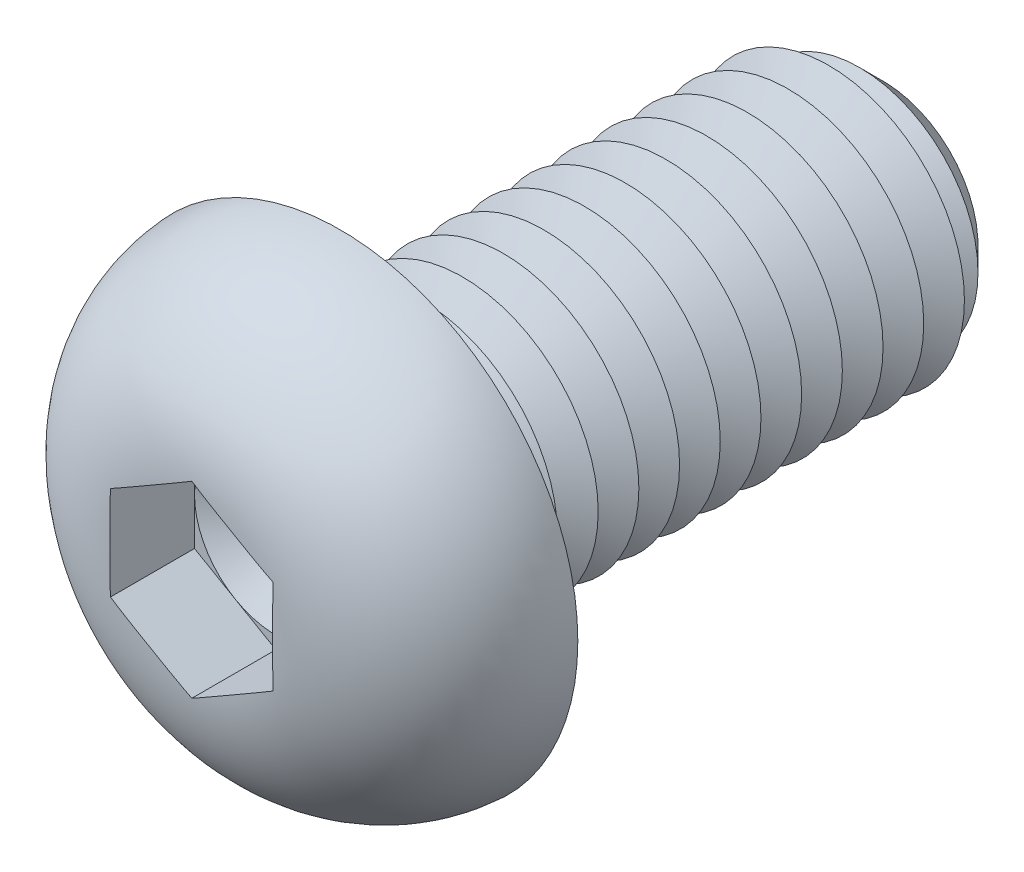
from build123d import *

# Parameters (mm, degrees)
CUT_EXTRUDE1_DEPTH  = 3.12
SKETCH4_R           = 5
BOSS_EXTRUDE1_DEPTH = 20
CHAMFER1_SIZE       = 1.5
LPATTERN1_COUNT     = 12
LPATTERN1_PITCH     = 1.5
FILLET2_R           = 0.6


with BuildPart() as part:
    # Sketch2 → Revolve1 (revolve)
    with BuildSketch(Plane(origin=(0, 0, 0), x_dir=(0, 0, -1), z_dir=(1, 0, 0)), mode=Mode.PRIVATE) as revolve1_sk:
        with BuildLine():
            Line((0, 0), (-5.5, 0))
            Line((-5.5, 0), (-5.5, 2.957763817))
            ThreePointArc((-5.5, 2.957763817), (-3.905948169, 6.951508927), (0, 8.75))
            Line((0, 8.75), (0, 0))
        make_face()
    revolve(revolve1_sk.sketch.rotate(Axis((0, 0, 47.934239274), (0, 0, -1)), 90), axis=Axis((0, 0, 47.934239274), (0, 0, -1)))

    # Sketch3 → Cut-Extrude1 (cut)
    with BuildSketch(Plane.XY.offset(5.5)):
        Polygon((0, 3.464101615), (-3, 1.732050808), (-3, -1.732050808), (0, -3.464101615), (3, -1.732050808), (3, 1.732050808), align=None)
    extrude(amount=-CUT_EXTRUDE1_DEPTH, mode=Mode.SUBTRACT)

    # Sketch4 → Boss-Extrude1 (add)
    with BuildSketch(Plane(origin=(0, 0, 0), x_dir=(-1, 0, 0), z_dir=(0, 0, -1))):
        with Locations(Location((0, 0, 0), (0, 0, 180))):
            Circle(SKETCH4_R)
    extrude(amount=BOSS_EXTRUDE1_DEPTH)

    # Chamfer1
    chamfer1_edges = [part.edges().sort_by_distance(p)[0] for p in [
        (-5, 0, -20),
    ]]
    chamfer(chamfer1_edges, length=CHAMFER1_SIZE)

    # Sketch5 → Cut-Revolve1 (revolve, cut)
    with BuildSketch(Plane(origin=(0, 0, 0), x_dir=(0, 0, -1), z_dir=(1, 0, 0)), mode=Mode.PRIVATE) as cut_revolve1_sk:
        Polygon((1.5, 5), (3, 5), (2.25, 3.700961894), align=None)
    cut_revolve1 = revolve(cut_revolve1_sk.sketch.rotate(Axis((0, 0, 47.934239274), (0, 0, -1)), 90), axis=Axis((0, 0, 47.934239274), (0, 0, -1)), mode=Mode.SUBTRACT)

    # LPattern1: Cut-Revolve1 ×12
    with Locations(*[(0, 0, -i * LPATTERN1_PITCH) for i in range(1, LPATTERN1_COUNT)]):
        add(cut_revolve1, mode=Mode.SUBTRACT)

    # Fillet2
    fillet2_edges = [part.edges().sort_by_distance(p)[0] for p in [
        (-5, 0, 0),
    ]]
    fillet(fillet2_edges, radius=FILLET2_R)

    # Cut-Extrude2 cone 1 section (on through the dimple's axis) → Cut-Extrude2 (revolve, cut)
    with BuildSketch(Plane(origin=(0, 0, 2.38), x_dir=(0, -1, 0), z_dir=(1, 0, 0))):
        Polygon((0, 0), (3, 0), (0, 1.732050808), align=None)
    revolve(axis=Axis((0, 0, 2.38), (0, 0, -1)), mode=Mode.SUBTRACT)


solid = part.part
